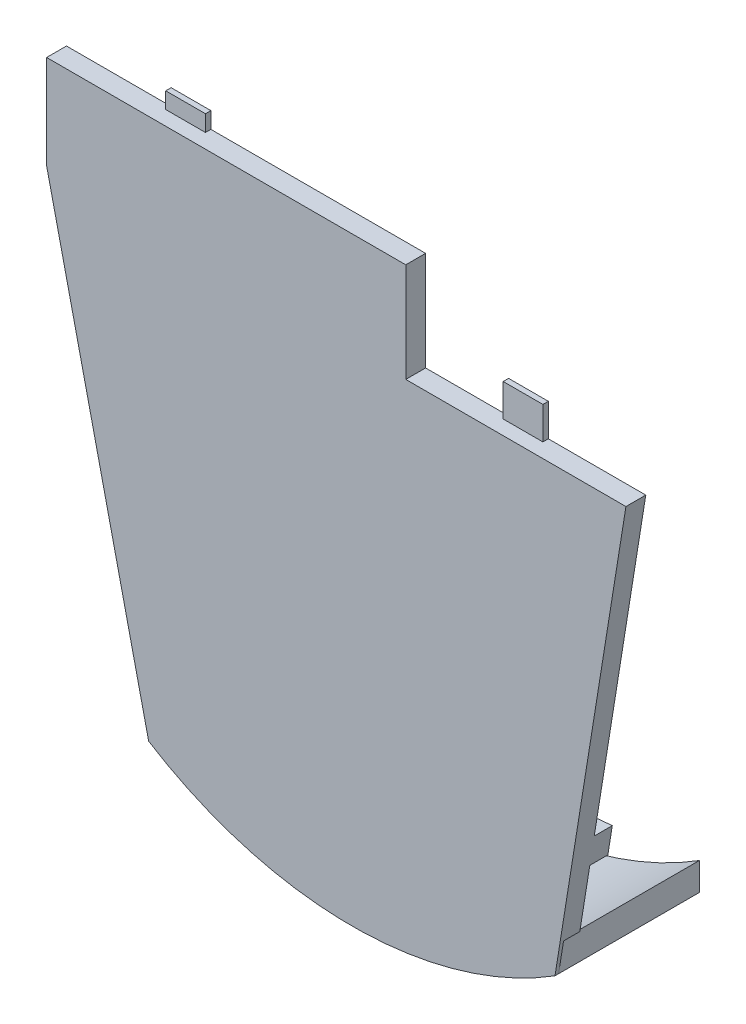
from build123d import *

# Parameters (mm, degrees)
BOSS_EXTRUDE1_DEPTH = 20.32
CUT_EXTRUDE2_DEPTH  = 17.526
SKETCH10_W          = 5.588
SKETCH10_H          = 2.286
SKETCH10_H_2        = 4.572
BOSS_EXTRUDE5_DEPTH = 0.762
CUT_EXTRUDE4_DEPTH  = 19.812
BOSS_EXTRUDE6_DEPTH = 2.54
BOSS_EXTRUDE7_DEPTH = 2.54


with BuildPart() as part:
    # Sketch1 → Boss-Extrude1 (new body)
    with BuildSketch(Plane.XY):
        with BuildLine():
            Line((-37.895369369, 2.54), (-52.256793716, 65.49768909))
            Line((-52.256793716, 65.49768909), (-52.256793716, 78.70568909))
            Line((-52.256793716, 78.70568909), (-1.710793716, 78.70568909))
            Line((-1.710793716, 78.70568909), (-1.710793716, 64.73568909))
            Line((-1.710793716, 64.73568909), (29.277206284, 64.73568909))
            Line((29.277206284, 64.73568909), (19.292802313, 2.54))
            ThreePointArc((19.292802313, 2.54), (-9.301283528, -5.679222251), (-37.895369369, 2.54))
        make_face()
    extrude(amount=BOSS_EXTRUDE1_DEPTH)

    # Sketch5 → Cut-Extrude2 (cut)
    with BuildSketch(Plane(origin=(0, 0, 0), x_dir=(-1, 0, 0), z_dir=(0, 0, -1))):
        with BuildLine():
            Line((-29.277206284, 64.73568909), (1.710793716, 64.73568909))
            Line((1.710793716, 64.73568909), (1.710793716, 78.70568909))
            Line((1.710793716, 78.70568909), (52.256793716, 78.70568909))
            Line((52.256793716, 78.70568909), (52.256793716, 65.49768909))
            Line((52.256793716, 65.49768909), (38.887115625, 6.887622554))
            ThreePointArc((38.887115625, 6.887622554), (9.448190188, -1.872055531), (-19.990735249, 6.887622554))
            Line((-19.990735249, 6.887622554), (-29.277206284, 64.73568909))
        make_face()
    extrude(amount=-CUT_EXTRUDE2_DEPTH, mode=Mode.SUBTRACT)

    # Sketch10 → Boss-Extrude5 (add)
    with BuildSketch(Plane(origin=(0, 0, 17.526), x_dir=(-1, 0, 0), z_dir=(0, 0, -1))):
        with Locations((34.730793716, 79.84868909)):
            Rectangle(SKETCH10_W, SKETCH10_H)
        with Locations((-12.767206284, 67.02168909)):
            Rectangle(SKETCH10_W, SKETCH10_H_2)
    extrude(amount=-BOSS_EXTRUDE5_DEPTH)

    # Sketch12 → Cut-Extrude4 (cut)
    with BuildSketch(Plane(origin=(0, 0, 0), x_dir=(-1, 0, 0), z_dir=(0, 0, -1))):
        Polygon((-19.292802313, 2.54), (-19.292802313, 6.482476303), (-19.990735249, 6.887622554), align=None)
        Polygon((37.895369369, 2.54), (37.895369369, 6.255433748), (38.887115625, 6.887622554), align=None)
    extrude(amount=-CUT_EXTRUDE4_DEPTH, mode=Mode.SUBTRACT)

    # Sketch19 → Boss-Extrude6 (add)
    with BuildSketch(Plane(origin=(0, 0, 17.526), x_dir=(-1, 0, 0), z_dir=(0, 0, -1))):
        Polygon((41.655098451, 19.021920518), (40.779512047, 15.183520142), (38.341408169, 15.90928454), (39.160505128, 19.500046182), align=None)
    extrude(amount=BOSS_EXTRUDE6_DEPTH)

    # Sketch20 → Boss-Extrude7 (add)
    with BuildSketch(Plane(origin=(0, 0, 17.526), x_dir=(-1, 0, 0), z_dir=(0, 0, -1))):
        Polygon((-22.023849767, 19.552470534), (-19.494958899, 19.315171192), (-18.942053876, 16.059791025), (-21.399824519, 15.665239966), align=None)
    extrude(amount=BOSS_EXTRUDE7_DEPTH)


solid = part.part
